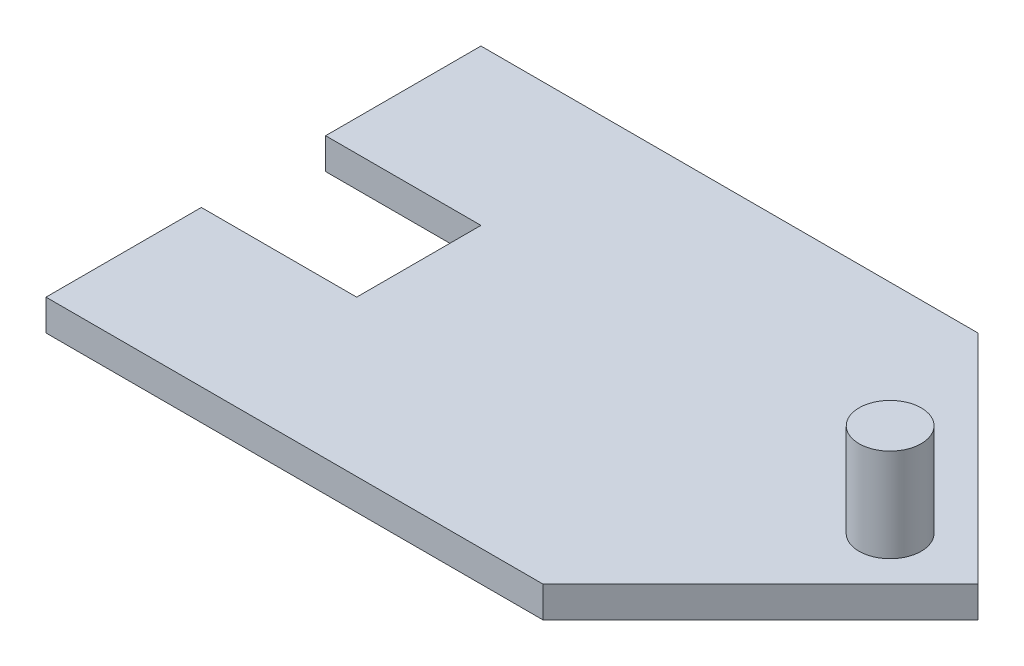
ISO-10303-21;
HEADER;
FILE_DESCRIPTION(('STEP AP214'),'2;1');
FILE_NAME('part.step','',(''),(''),'','','');
FILE_SCHEMA(('AUTOMOTIVE_DESIGN { 1 0 10303 214 1 1 1 1 }'));
ENDSEC;
DATA;
#1=APPLICATION_CONTEXT('core data for automotive mechanical design processes');
#2=APPLICATION_PROTOCOL_DEFINITION('international standard','automotive_design',2000,#1);
#3=PRODUCT_CONTEXT('',#1,'mechanical');
#4=PRODUCT('Part','Part','',(#3));
#5=PRODUCT_RELATED_PRODUCT_CATEGORY('part','',(#4));
#6=PRODUCT_DEFINITION_FORMATION('','',#4);
#7=PRODUCT_DEFINITION_CONTEXT('part definition',#1,'design');
#8=PRODUCT_DEFINITION('design','',#6,#7);
#9=PRODUCT_DEFINITION_SHAPE('','',#8);
#10=(LENGTH_UNIT() NAMED_UNIT(*) SI_UNIT(.MILLI.,.METRE.));
#11=(NAMED_UNIT(*) PLANE_ANGLE_UNIT() SI_UNIT($,.RADIAN.));
#12=(NAMED_UNIT(*) SI_UNIT($,.STERADIAN.) SOLID_ANGLE_UNIT());
#13=UNCERTAINTY_MEASURE_WITH_UNIT(LENGTH_MEASURE(1.E-05),#10,'distance_accuracy_value','');
#14=(GEOMETRIC_REPRESENTATION_CONTEXT(3) GLOBAL_UNCERTAINTY_ASSIGNED_CONTEXT((#13)) GLOBAL_UNIT_ASSIGNED_CONTEXT((#10,
#11,#12)) REPRESENTATION_CONTEXT('',''));
#15=CARTESIAN_POINT('',(0.,0.,0.));
#16=DIRECTION('',(0.,0.,1.));
#17=DIRECTION('',(1.,0.,0.));
#18=AXIS2_PLACEMENT_3D('',#15,#16,#17);
#19=CARTESIAN_POINT('',(0.,5.,0.));
#20=DIRECTION('',(0.,1.,0.));
#21=DIRECTION('',(0.,0.,1.));
#22=AXIS2_PLACEMENT_3D('',#19,#20,#21);
#23=PLANE('',#22);
#24=DIRECTION('',(0.,0.,1.));
#25=VECTOR('',#24,1.);
#26=CARTESIAN_POINT('',(0.,5.,-25.));
#27=LINE('',#26,#25);
#28=CARTESIAN_POINT('',(0.,5.,-25.));
#29=VERTEX_POINT('',#28);
#30=CARTESIAN_POINT('',(0.,5.,0.));
#31=VERTEX_POINT('',#30);
#32=EDGE_CURVE('E142',#29,#31,#27,.T.);
#33=ORIENTED_EDGE('',*,*,#32,.T.);
#34=DIRECTION('',(1.,0.,0.));
#35=VECTOR('',#34,1.);
#36=CARTESIAN_POINT('',(0.,5.,0.));
#37=LINE('',#36,#35);
#38=CARTESIAN_POINT('',(80.,5.,0.));
#39=VERTEX_POINT('',#38);
#40=EDGE_CURVE('E117',#31,#39,#37,.T.);
#41=ORIENTED_EDGE('',*,*,#40,.T.);
#42=DIRECTION('',(0.707106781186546,0.,-0.707106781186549));
#43=VECTOR('',#42,1.);
#44=CARTESIAN_POINT('',(80.,5.,0.));
#45=LINE('',#44,#43);
#46=CARTESIAN_POINT('',(115.,5.,-35.0000000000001));
#47=VERTEX_POINT('',#46);
#48=EDGE_CURVE('E145',#39,#47,#45,.T.);
#49=ORIENTED_EDGE('',*,*,#48,.T.);
#50=DIRECTION('',(-0.707106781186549,0.,-0.707106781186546));
#51=VECTOR('',#50,1.);
#52=CARTESIAN_POINT('',(115.,5.,-35.0000000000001));
#53=LINE('',#52,#51);
#54=CARTESIAN_POINT('',(80.,5.,-70.));
#55=VERTEX_POINT('',#54);
#56=EDGE_CURVE('E147',#47,#55,#53,.T.);
#57=ORIENTED_EDGE('',*,*,#56,.T.);
#58=DIRECTION('',(-1.,0.,0.));
#59=VECTOR('',#58,1.);
#60=CARTESIAN_POINT('',(80.,5.,-70.));
#61=LINE('',#60,#59);
#62=CARTESIAN_POINT('',(0.,5.,-70.));
#63=VERTEX_POINT('',#62);
#64=EDGE_CURVE('E149',#55,#63,#61,.T.);
#65=ORIENTED_EDGE('',*,*,#64,.T.);
#66=DIRECTION('',(0.,0.,1.));
#67=VECTOR('',#66,1.);
#68=CARTESIAN_POINT('',(0.,5.,-70.));
#69=LINE('',#68,#67);
#70=CARTESIAN_POINT('',(0.,5.,-45.));
#71=VERTEX_POINT('',#70);
#72=EDGE_CURVE('E151',#63,#71,#69,.T.);
#73=ORIENTED_EDGE('',*,*,#72,.T.);
#74=DIRECTION('',(1.,0.,0.));
#75=VECTOR('',#74,1.);
#76=CARTESIAN_POINT('',(0.,5.,-45.));
#77=LINE('',#76,#75);
#78=CARTESIAN_POINT('',(25.,5.,-45.));
#79=VERTEX_POINT('',#78);
#80=EDGE_CURVE('E153',#71,#79,#77,.T.);
#81=ORIENTED_EDGE('',*,*,#80,.T.);
#82=DIRECTION('',(0.,0.,1.));
#83=VECTOR('',#82,1.);
#84=CARTESIAN_POINT('',(25.,5.,-45.));
#85=LINE('',#84,#83);
#86=CARTESIAN_POINT('',(25.,5.,-25.));
#87=VERTEX_POINT('',#86);
#88=EDGE_CURVE('E53',#79,#87,#85,.T.);
#89=ORIENTED_EDGE('',*,*,#88,.T.);
#90=DIRECTION('',(-1.,0.,0.));
#91=VECTOR('',#90,1.);
#92=CARTESIAN_POINT('',(25.,5.,-25.));
#93=LINE('',#92,#91);
#94=EDGE_CURVE('E48',#87,#29,#93,.T.);
#95=ORIENTED_EDGE('',*,*,#94,.T.);
#96=EDGE_LOOP('',(#33,#41,#49,#57,#65,#73,#81,#89,#95));
#97=FACE_BOUND('',#96,.T.);
#98=CARTESIAN_POINT('',(100.857864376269,5.,-35.0000000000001));
#99=DIRECTION('',(0.,1.,0.));
#100=DIRECTION('',(0.,0.,1.));
#101=AXIS2_PLACEMENT_3D('',#98,#99,#100);
#102=CIRCLE('',#101,5.00000000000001);
#103=CARTESIAN_POINT('',(100.857864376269,5.,-30.0000000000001));
#104=VERTEX_POINT('',#103);
#105=EDGE_CURVE('E125',#104,#104,#102,.T.);
#106=ORIENTED_EDGE('',*,*,#105,.F.);
#107=EDGE_LOOP('',(#106));
#108=FACE_BOUND('',#107,.T.);
#109=ADVANCED_FACE('F33',(#97,#108),#23,.T.);
#110=CARTESIAN_POINT('',(0.,5.,-25.));
#111=DIRECTION('',(1.,0.,0.));
#112=DIRECTION('',(0.,0.,-1.));
#113=AXIS2_PLACEMENT_3D('',#110,#111,#112);
#114=PLANE('',#113);
#115=DIRECTION('',(0.,0.,1.));
#116=VECTOR('',#115,1.);
#117=CARTESIAN_POINT('',(0.,0.,-25.));
#118=LINE('',#117,#116);
#119=CARTESIAN_POINT('',(0.,0.,-25.));
#120=VERTEX_POINT('',#119);
#121=CARTESIAN_POINT('',(0.,0.,0.));
#122=VERTEX_POINT('',#121);
#123=EDGE_CURVE('E108',#120,#122,#118,.T.);
#124=ORIENTED_EDGE('',*,*,#123,.T.);
#125=DIRECTION('',(0.,-1.,0.));
#126=VECTOR('',#125,1.);
#127=CARTESIAN_POINT('',(0.,5.,0.));
#128=LINE('',#127,#126);
#129=EDGE_CURVE('E11',#31,#122,#128,.T.);
#130=ORIENTED_EDGE('',*,*,#129,.F.);
#131=ORIENTED_EDGE('',*,*,#32,.F.);
#132=DIRECTION('',(0.,-1.,0.));
#133=VECTOR('',#132,1.);
#134=CARTESIAN_POINT('',(0.,5.,-25.));
#135=LINE('',#134,#133);
#136=EDGE_CURVE('E121',#29,#120,#135,.T.);
#137=ORIENTED_EDGE('',*,*,#136,.T.);
#138=EDGE_LOOP('',(#124,#130,#131,#137));
#139=FACE_BOUND('',#138,.T.);
#140=ADVANCED_FACE('F35',(#139),#114,.F.);
#141=CARTESIAN_POINT('',(0.,5.,0.));
#142=DIRECTION('',(0.,0.,-1.));
#143=DIRECTION('',(-1.,0.,0.));
#144=AXIS2_PLACEMENT_3D('',#141,#142,#143);
#145=PLANE('',#144);
#146=DIRECTION('',(1.,0.,0.));
#147=VECTOR('',#146,1.);
#148=CARTESIAN_POINT('',(0.,0.,0.));
#149=LINE('',#148,#147);
#150=CARTESIAN_POINT('',(80.,0.,0.));
#151=VERTEX_POINT('',#150);
#152=EDGE_CURVE('E104',#122,#151,#149,.T.);
#153=ORIENTED_EDGE('',*,*,#152,.T.);
#154=DIRECTION('',(0.,-1.,0.));
#155=VECTOR('',#154,1.);
#156=CARTESIAN_POINT('',(80.,5.,0.));
#157=LINE('',#156,#155);
#158=EDGE_CURVE('E41',#39,#151,#157,.T.);
#159=ORIENTED_EDGE('',*,*,#158,.F.);
#160=ORIENTED_EDGE('',*,*,#40,.F.);
#161=ORIENTED_EDGE('',*,*,#129,.T.);
#162=EDGE_LOOP('',(#153,#159,#160,#161));
#163=FACE_BOUND('',#162,.T.);
#164=ADVANCED_FACE('F116',(#163),#145,.F.);
#165=CARTESIAN_POINT('',(80.,5.,0.));
#166=DIRECTION('',(-0.707106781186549,0.,-0.707106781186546));
#167=DIRECTION('',(-0.707106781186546,0.,0.707106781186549));
#168=AXIS2_PLACEMENT_3D('',#165,#166,#167);
#169=PLANE('',#168);
#170=DIRECTION('',(0.707106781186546,0.,-0.707106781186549));
#171=VECTOR('',#170,1.);
#172=CARTESIAN_POINT('',(80.,0.,0.));
#173=LINE('',#172,#171);
#174=CARTESIAN_POINT('',(115.,0.,-35.0000000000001));
#175=VERTEX_POINT('',#174);
#176=EDGE_CURVE('E110',#151,#175,#173,.T.);
#177=ORIENTED_EDGE('',*,*,#176,.T.);
#178=DIRECTION('',(0.,-1.,0.));
#179=VECTOR('',#178,1.);
#180=CARTESIAN_POINT('',(115.,5.,-35.0000000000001));
#181=LINE('',#180,#179);
#182=EDGE_CURVE('E173',#47,#175,#181,.T.);
#183=ORIENTED_EDGE('',*,*,#182,.F.);
#184=ORIENTED_EDGE('',*,*,#48,.F.);
#185=ORIENTED_EDGE('',*,*,#158,.T.);
#186=EDGE_LOOP('',(#177,#183,#184,#185));
#187=FACE_BOUND('',#186,.T.);
#188=ADVANCED_FACE('F177',(#187),#169,.F.);
#189=CARTESIAN_POINT('',(115.,5.,-35.0000000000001));
#190=DIRECTION('',(-0.707106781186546,0.,0.707106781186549));
#191=DIRECTION('',(0.707106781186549,0.,0.707106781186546));
#192=AXIS2_PLACEMENT_3D('',#189,#190,#191);
#193=PLANE('',#192);
#194=DIRECTION('',(-0.707106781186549,0.,-0.707106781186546));
#195=VECTOR('',#194,1.);
#196=CARTESIAN_POINT('',(115.,0.,-35.0000000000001));
#197=LINE('',#196,#195);
#198=CARTESIAN_POINT('',(80.,0.,-70.));
#199=VERTEX_POINT('',#198);
#200=EDGE_CURVE('E130',#175,#199,#197,.T.);
#201=ORIENTED_EDGE('',*,*,#200,.T.);
#202=DIRECTION('',(0.,-1.,0.));
#203=VECTOR('',#202,1.);
#204=CARTESIAN_POINT('',(80.,5.,-70.));
#205=LINE('',#204,#203);
#206=EDGE_CURVE('E170',#55,#199,#205,.T.);
#207=ORIENTED_EDGE('',*,*,#206,.F.);
#208=ORIENTED_EDGE('',*,*,#56,.F.);
#209=ORIENTED_EDGE('',*,*,#182,.T.);
#210=EDGE_LOOP('',(#201,#207,#208,#209));
#211=FACE_BOUND('',#210,.T.);
#212=ADVANCED_FACE('F185',(#211),#193,.F.);
#213=CARTESIAN_POINT('',(80.,5.,-70.));
#214=DIRECTION('',(0.,0.,1.));
#215=DIRECTION('',(1.,0.,0.));
#216=AXIS2_PLACEMENT_3D('',#213,#214,#215);
#217=PLANE('',#216);
#218=DIRECTION('',(-1.,0.,0.));
#219=VECTOR('',#218,1.);
#220=CARTESIAN_POINT('',(80.,0.,-70.));
#221=LINE('',#220,#219);
#222=CARTESIAN_POINT('',(0.,0.,-70.));
#223=VERTEX_POINT('',#222);
#224=EDGE_CURVE('E132',#199,#223,#221,.T.);
#225=ORIENTED_EDGE('',*,*,#224,.T.);
#226=DIRECTION('',(0.,-1.,0.));
#227=VECTOR('',#226,1.);
#228=CARTESIAN_POINT('',(0.,5.,-70.));
#229=LINE('',#228,#227);
#230=EDGE_CURVE('E167',#63,#223,#229,.T.);
#231=ORIENTED_EDGE('',*,*,#230,.F.);
#232=ORIENTED_EDGE('',*,*,#64,.F.);
#233=ORIENTED_EDGE('',*,*,#206,.T.);
#234=EDGE_LOOP('',(#225,#231,#232,#233));
#235=FACE_BOUND('',#234,.T.);
#236=ADVANCED_FACE('F188',(#235),#217,.F.);
#237=CARTESIAN_POINT('',(0.,5.,-70.));
#238=DIRECTION('',(1.,0.,0.));
#239=DIRECTION('',(0.,0.,-1.));
#240=AXIS2_PLACEMENT_3D('',#237,#238,#239);
#241=PLANE('',#240);
#242=DIRECTION('',(0.,0.,1.));
#243=VECTOR('',#242,1.);
#244=CARTESIAN_POINT('',(0.,0.,-70.));
#245=LINE('',#244,#243);
#246=CARTESIAN_POINT('',(0.,0.,-45.));
#247=VERTEX_POINT('',#246);
#248=EDGE_CURVE('E134',#223,#247,#245,.T.);
#249=ORIENTED_EDGE('',*,*,#248,.T.);
#250=DIRECTION('',(0.,-1.,0.));
#251=VECTOR('',#250,1.);
#252=CARTESIAN_POINT('',(0.,5.,-45.));
#253=LINE('',#252,#251);
#254=EDGE_CURVE('E164',#71,#247,#253,.T.);
#255=ORIENTED_EDGE('',*,*,#254,.F.);
#256=ORIENTED_EDGE('',*,*,#72,.F.);
#257=ORIENTED_EDGE('',*,*,#230,.T.);
#258=EDGE_LOOP('',(#249,#255,#256,#257));
#259=FACE_BOUND('',#258,.T.);
#260=ADVANCED_FACE('F193',(#259),#241,.F.);
#261=CARTESIAN_POINT('',(0.,5.,-45.));
#262=DIRECTION('',(0.,0.,-1.));
#263=DIRECTION('',(-1.,0.,0.));
#264=AXIS2_PLACEMENT_3D('',#261,#262,#263);
#265=PLANE('',#264);
#266=DIRECTION('',(1.,0.,0.));
#267=VECTOR('',#266,1.);
#268=CARTESIAN_POINT('',(0.,0.,-45.));
#269=LINE('',#268,#267);
#270=CARTESIAN_POINT('',(25.,0.,-45.));
#271=VERTEX_POINT('',#270);
#272=EDGE_CURVE('E136',#247,#271,#269,.T.);
#273=ORIENTED_EDGE('',*,*,#272,.T.);
#274=DIRECTION('',(0.,-1.,0.));
#275=VECTOR('',#274,1.);
#276=CARTESIAN_POINT('',(25.,5.,-45.));
#277=LINE('',#276,#275);
#278=EDGE_CURVE('E161',#79,#271,#277,.T.);
#279=ORIENTED_EDGE('',*,*,#278,.F.);
#280=ORIENTED_EDGE('',*,*,#80,.F.);
#281=ORIENTED_EDGE('',*,*,#254,.T.);
#282=EDGE_LOOP('',(#273,#279,#280,#281));
#283=FACE_BOUND('',#282,.T.);
#284=ADVANCED_FACE('F197',(#283),#265,.F.);
#285=CARTESIAN_POINT('',(25.,5.,-45.));
#286=DIRECTION('',(1.,0.,0.));
#287=DIRECTION('',(0.,0.,-1.));
#288=AXIS2_PLACEMENT_3D('',#285,#286,#287);
#289=PLANE('',#288);
#290=DIRECTION('',(0.,0.,1.));
#291=VECTOR('',#290,1.);
#292=CARTESIAN_POINT('',(25.,0.,-45.));
#293=LINE('',#292,#291);
#294=CARTESIAN_POINT('',(25.,0.,-25.));
#295=VERTEX_POINT('',#294);
#296=EDGE_CURVE('E138',#271,#295,#293,.T.);
#297=ORIENTED_EDGE('',*,*,#296,.T.);
#298=DIRECTION('',(0.,-1.,0.));
#299=VECTOR('',#298,1.);
#300=CARTESIAN_POINT('',(25.,5.,-25.));
#301=LINE('',#300,#299);
#302=EDGE_CURVE('E158',#87,#295,#301,.T.);
#303=ORIENTED_EDGE('',*,*,#302,.F.);
#304=ORIENTED_EDGE('',*,*,#88,.F.);
#305=ORIENTED_EDGE('',*,*,#278,.T.);
#306=EDGE_LOOP('',(#297,#303,#304,#305));
#307=FACE_BOUND('',#306,.T.);
#308=ADVANCED_FACE('F201',(#307),#289,.F.);
#309=CARTESIAN_POINT('',(25.,5.,-25.));
#310=DIRECTION('',(0.,0.,1.));
#311=DIRECTION('',(1.,0.,0.));
#312=AXIS2_PLACEMENT_3D('',#309,#310,#311);
#313=PLANE('',#312);
#314=DIRECTION('',(-1.,0.,0.));
#315=VECTOR('',#314,1.);
#316=CARTESIAN_POINT('',(25.,0.,-25.));
#317=LINE('',#316,#315);
#318=EDGE_CURVE('E140',#295,#120,#317,.T.);
#319=ORIENTED_EDGE('',*,*,#318,.T.);
#320=ORIENTED_EDGE('',*,*,#136,.F.);
#321=ORIENTED_EDGE('',*,*,#94,.F.);
#322=ORIENTED_EDGE('',*,*,#302,.T.);
#323=EDGE_LOOP('',(#319,#320,#321,#322));
#324=FACE_BOUND('',#323,.T.);
#325=ADVANCED_FACE('F203',(#324),#313,.F.);
#326=CARTESIAN_POINT('',(0.,0.,0.));
#327=DIRECTION('',(0.,1.,0.));
#328=DIRECTION('',(0.,0.,1.));
#329=AXIS2_PLACEMENT_3D('',#326,#327,#328);
#330=PLANE('',#329);
#331=ORIENTED_EDGE('',*,*,#123,.F.);
#332=ORIENTED_EDGE('',*,*,#318,.F.);
#333=ORIENTED_EDGE('',*,*,#296,.F.);
#334=ORIENTED_EDGE('',*,*,#272,.F.);
#335=ORIENTED_EDGE('',*,*,#248,.F.);
#336=ORIENTED_EDGE('',*,*,#224,.F.);
#337=ORIENTED_EDGE('',*,*,#200,.F.);
#338=ORIENTED_EDGE('',*,*,#176,.F.);
#339=ORIENTED_EDGE('',*,*,#152,.F.);
#340=EDGE_LOOP('',(#331,#332,#333,#334,#335,#336,#337,#338,#339));
#341=FACE_BOUND('',#340,.T.);
#342=ADVANCED_FACE('F105',(#341),#330,.F.);
#343=CARTESIAN_POINT('',(100.857864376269,20.,-35.0000000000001));
#344=DIRECTION('',(0.,-1.,0.));
#345=DIRECTION('',(0.,0.,-1.));
#346=AXIS2_PLACEMENT_3D('',#343,#344,#345);
#347=CYLINDRICAL_SURFACE('',#346,5.00000000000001);
#348=CARTESIAN_POINT('',(100.857864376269,20.,-35.0000000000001));
#349=DIRECTION('',(0.,1.,0.));
#350=DIRECTION('',(0.,0.,1.));
#351=AXIS2_PLACEMENT_3D('',#348,#349,#350);
#352=CIRCLE('',#351,5.00000000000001);
#353=CARTESIAN_POINT('',(100.857864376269,20.,-30.0000000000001));
#354=VERTEX_POINT('',#353);
#355=EDGE_CURVE('E122',#354,#354,#352,.T.);
#356=ORIENTED_EDGE('',*,*,#355,.F.);
#357=EDGE_LOOP('',(#356));
#358=FACE_BOUND('',#357,.T.);
#359=ORIENTED_EDGE('',*,*,#105,.T.);
#360=EDGE_LOOP('',(#359));
#361=FACE_BOUND('',#360,.T.);
#362=ADVANCED_FACE('F210',(#358,#361),#347,.T.);
#363=CARTESIAN_POINT('',(100.857864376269,20.,-35.0000000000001));
#364=DIRECTION('',(0.,1.,0.));
#365=DIRECTION('',(0.,0.,1.));
#366=AXIS2_PLACEMENT_3D('',#363,#364,#365);
#367=PLANE('',#366);
#368=ORIENTED_EDGE('',*,*,#355,.T.);
#369=EDGE_LOOP('',(#368));
#370=FACE_BOUND('',#369,.T.);
#371=ADVANCED_FACE('F221',(#370),#367,.T.);
#372=CLOSED_SHELL('',(#109,#140,#164,#188,#212,#236,#260,#284,#308,#325,#342,#362,#371));
#373=MANIFOLD_SOLID_BREP('B2',#372);
#374=ADVANCED_BREP_SHAPE_REPRESENTATION('',(#18,#373),#14);
#375=SHAPE_DEFINITION_REPRESENTATION(#9,#374);
ENDSEC;
END-ISO-10303-21;
